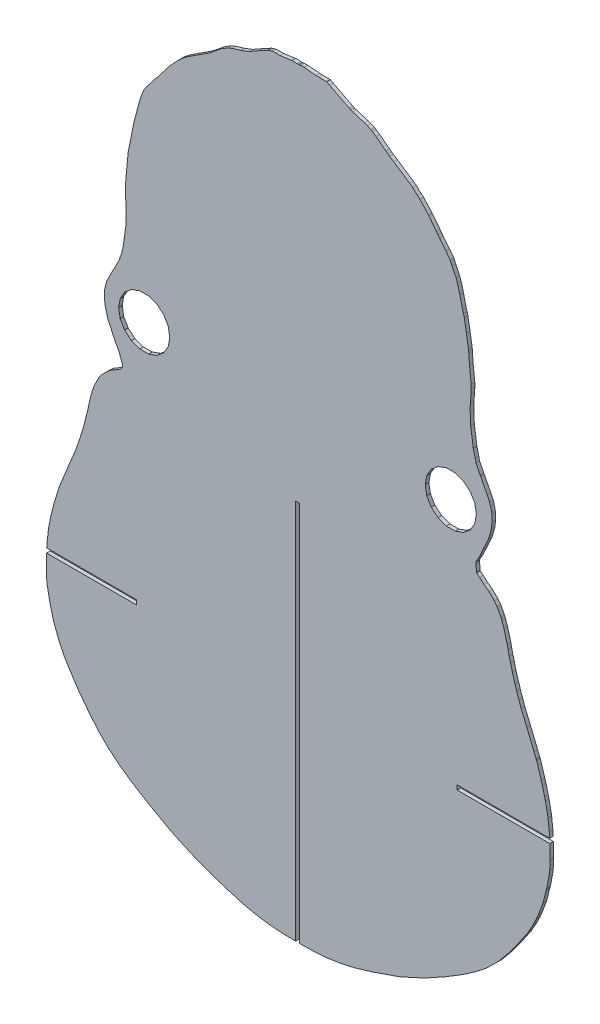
from build123d import *

# Parameters (mm, degrees)
EXTRUDE_1_DEPTH = 2


with BuildPart() as part:
    # Model → Extrude 1 (new body)
    with BuildSketch(Plane.XY):
        Polygon((-4974.158, -929.7955), (-4968.6351, -930.2084), (-4965.1293, -930.3378), (-4959.8611, -930.4225), (-4959.8611, -719.0788), (-4957.8611, -719.0788), (-4957.8611, -930.4371), (-4951.7398, -930.3629), (-4949.5986, -930.2921), (-4947.9002, -930.1979), (-4942.8325, -929.8058), (-4942.4503, -929.756), (-4935.1129, -928.6329), (-4934.8096, -928.5712), (-4934.5061, -928.5092), (-4927.6871, -926.9908), (-4926.8901, -926.7667), (-4921.6101, -925.1852), (-4919.9321, -924.703), (-4918.2541, -924.2206), (-4908.5771, -920.9071), (-4902.6554, -918.8368), (-4896.7513, -916.2242), (-4888.4404, -912.3805), (-4887.0179, -911.6324), (-4883.3795, -909.6022), (-4877.945, -906.5407), (-4877.4139, -906.285), (-4876.8827, -906.0292), (-4870.752, -902.2738), (-4865.5499, -899.0272), (-4864.6683, -898.4178), (-4863.5197, -897.5741), (-4862.3711, -896.7306), (-4859.876, -895.0631), (-4856.9983, -892.7367), (-4854.0229, -890.3763), (-4848.1192, -884.5961), (-4846.7538, -883.0995), (-4842.3308, -877.7321), (-4836.8335, -870.3651), (-4832.9334, -864.5707), (-4831.4924, -862.5199), (-4830.8341, -861.4086), (-4830.6526, -861.0438), (-4830.4712, -860.6793), (-4828.6733, -857.6239), (-4828.1669, -856.5897), (-4826.4759, -853.1464), (-4825.3825, -850.5316), (-4822.6957, -843.3907), (-4822.6899, -843.3458), (-4822.6841, -843.3009), (-4821.1044, -836.9054), (-4820.9418, -836.3578), (-4820.7793, -835.8099), (-4820.6542, -835.2631), (-4819.4245, -829.0065), (-4819.0711, -826.1041), (-4818.8331, -823.6173), (-4818.8422, -821.382), (-4818.8378, -821.0985), (-4818.8757, -820.3788), (-4818.9844, -813.0892), (-4870.3844, -813.0892), (-4870.3844, -812.8392), (-4870.3844, -810.8392), (-4870.3844, -810.5892), (-4819.0458, -810.5892), (-4819.2605, -807.7255), (-4819.9747, -801.4142), (-4820.2251, -799.7928), (-4821.3856, -793.9696), (-4821.8597, -792.1036), (-4823.0798, -787.2887), (-4823.752, -784.9999), (-4825.7052, -778.6901), (-4826.2635, -777.0309), (-4826.3465, -776.7943), (-4826.4295, -776.558), (-4826.5423, -776.2694), (-4826.6551, -775.9811), (-4827.7262, -773.4261), (-4831.693, -763.6888), (-4834.8637, -756.1723), (-4836.147, -752.5556), (-4837.3583, -749.0107), (-4838.2948, -746.0696), (-4839.7543, -741.1841), (-4840.73, -737.2285), (-4841.5153, -734.2759), (-4842.1721, -731.301), (-4842.5612, -729.4475), (-4844.4167, -722.4553), (-4845.615, -719.1135), (-4846.1162, -717.8667), (-4848.1593, -714.0344), (-4849.7675, -711.9243), (-4852.7505, -708.843), (-4855.4501, -706.9629), (-4857.8761, -704.7331), (-4859.5853, -703.469), (-4859.6002, -703.4375), (-4859.6152, -703.406), (-4859.6202, -703.1538), (-4859.9137, -699.2248), (-4859.8963, -698.3071), (-4859.1325, -696.74), (-4857.966, -694.8115), (-4856.0334, -690.5195), (-4856.0329, -690.5183), (-4856.0325, -690.5173), (-4856.0322, -690.5163), (-4852.987, -683.9487), (-4852.4202, -682.0217), (-4851.3934, -678.1655), (-4851.0131, -674.6946), (-4851.1242, -670.8762), (-4851.28, -669.9158), (-4851.8411, -667.6953), (-4852.3329, -665.9238), (-4853.6626, -662.9949), (-4857.2618, -656.0876), (-4857.4419, -655.7597), (-4857.6221, -655.4321), (-4857.6708, -655.3193), (-4859.894, -650.8657), (-4860.3363, -648.8789), (-4861.37, -644.7202), (-4861.4316, -644.3179), (-4862.8359, -634.3913), (-4862.841, -634.3581), (-4862.8462, -634.3249), (-4862.8466, -634.3218), (-4862.847, -634.3186), (-4863.1181, -627.4463), (-4863.0723, -623.7153), (-4862.6688, -619.4426), (-4862.5345, -616.4482), (-4862.5747, -614.5293), (-4863.5302, -605.414), (-4863.9102, -600.1826), (-4863.9584, -598.9465), (-4864.0995, -597.9158), (-4865.1712, -591.3637), (-4866.3972, -584.3789), (-4866.7994, -582.813), (-4867.3376, -580.9602), (-4868.8091, -574.6103), (-4870.1731, -569.5923), (-4871.0017, -567.237), (-4873.1798, -562.8191), (-4874.2875, -560.3891), (-4876.5796, -557.3596), (-4880.1191, -553.0461), (-4881.0413, -551.7251), (-4881.8473, -550.5952), (-4886.07, -545.1618), (-4886.1833, -545.021), (-4886.2966, -544.8804), (-4891.0608, -539.6433), (-4892.4383, -538.5622), (-4895.2125, -535.8989), (-4896.6491, -534.8926), (-4905.5206, -528.9497), (-4907.8607, -527.4783), (-4908.7246, -526.8691), (-4909.7869, -526.008), (-4915.2931, -521.7969), (-4917.3051, -520.4197), (-4917.7934, -520.1213), (-4918.2818, -519.823), (-4920.2479, -518.9287), (-4921.712, -518.3862), (-4928.1213, -516.4355), (-4928.5135, -516.3276), (-4928.9057, -516.2197), (-4929.3313, -516.0168), (-4929.8046, -515.7688), (-4930.2778, -515.5207), (-4941.071, -510.0259), (-4942.542, -509.2473), (-4942.7693, -509.1418), (-4947.0627, -509.094), (-4948.4269, -509.0908), (-4948.4885, -509.094), (-4948.55, -509.0974), (-4954.9997, -508.4509), (-4955.3121, -508.4067), (-4956.9597, -508.5312), (-4957.3478, -508.5642), (-4957.7359, -508.5971), (-4957.8421, -508.6238), (-4957.9483, -508.6504), (-4958.0066, -508.6513), (-4958.4723, -508.6294), (-4958.9379, -508.6076), (-4961.6012, -508.5432), (-4962.0373, -508.5957), (-4962.2339, -508.6333), (-4962.4303, -508.6709), (-4968.7091, -509.5178), (-4969.7684, -509.4753), (-4970.8276, -509.4328), (-4972.7218, -509.5388), (-4973.7364, -509.8718), (-4974.7509, -510.2051), (-4975.3609, -510.344), (-4977.9656, -511.8984), (-4979.7461, -512.7612), (-4985.8459, -516.2109), (-4990.3016, -517.8916), (-4990.573, -517.968), (-4994.9819, -519.2717), (-4997.1963, -520.2471), (-5000.6361, -522.1443), (-5000.9295, -522.3701), (-5001.2229, -522.5959), (-5007.8338, -527.9165), (-5013.9421, -531.8899), (-5019.9042, -535.7637), (-5023.0545, -538.1955), (-5025.4924, -540.4707), (-5029.9923, -545.3574), (-5030.0162, -545.3869), (-5030.04, -545.4165), (-5030.2854, -545.7341), (-5036.7858, -554.2068), (-5037.5456, -555.0381), (-5038.4139, -556.0493), (-5040.6311, -559.0368), (-5042.7709, -561.7732), (-5044.0081, -563.6841), (-5045.2438, -566.5271), (-5046.164, -569.4292), (-5046.6401, -570.9145), (-5049.4321, -581.6291), (-5049.4399, -581.6565), (-5049.4477, -581.6838), (-5049.4604, -581.7261), (-5049.4732, -581.7683), (-5050.3082, -585.8926), (-5052.7453, -597.9602), (-5053.0653, -601.185), (-5054.2401, -614.0129), (-5054.3111, -616.4817), (-5054.1294, -620.865), (-5053.8653, -624.2263), (-5053.8126, -627.0261), (-5054.0817, -634.468), (-5054.0818, -634.4709), (-5054.0818, -634.4741), (-5054.0818, -634.4753), (-5054.082, -634.478), (-5055.513, -644.4607), (-5055.6158, -645.0737), (-5056.5313, -649.0344), (-5057.1505, -650.3149), (-5057.5707, -652.0019), (-5059.2935, -655.3701), (-5059.3111, -655.4184), (-5059.3287, -655.467), (-5059.3846, -655.5666), (-5059.4406, -655.6665), (-5063.3718, -663.1562), (-5064.6885, -666.0378), (-5065.1107, -667.7178), (-5065.6793, -669.821), (-5065.8625, -670.8962), (-5065.9435, -674.4319), (-5065.525, -677.9663), (-5064.442, -682.1885), (-5063.8631, -684.1135), (-5062.1041, -687.7156), (-5061.7643, -688.6572), (-5061.323, -689.675), (-5058.7935, -694.5998), (-5057.3415, -697.331), (-5057.1786, -698.1245), (-5055.9685, -701.3669), (-5055.9156, -702.7766), (-5057.136, -704.5237), (-5061.8888, -707.1865), (-5063.264, -708.1726), (-5063.5638, -708.4267), (-5063.8636, -708.6809), (-5067.2123, -711.9514), (-5067.8894, -712.8371), (-5068.7171, -713.8647), (-5069.3651, -715.1662), (-5071.3375, -718.8957), (-5072.6297, -722.4228), (-5074.1659, -728.3747), (-5074.7159, -730.8867), (-5075.4173, -734.1169), (-5076.2616, -737.3086), (-5077.2062, -741.1899), (-5078.5041, -745.5989), (-5079.3273, -748.2143), (-5080.6569, -752.125), (-5082.0079, -755.9734), (-5085.2583, -763.7289), (-5089.6342, -774.4716), (-5090.5229, -776.5992), (-5090.6801, -777.0006), (-5090.7388, -777.1683), (-5090.7975, -777.3361), (-5091.1838, -778.4845), (-5093.0766, -784.6451), (-5093.8112, -787.0807), (-5095.1102, -792.184), (-5095.5961, -794.0072), (-5096.8094, -800.1559), (-5097.0365, -801.7372), (-5097.7363, -808.0878), (-5097.9212, -810.5892), (-5048.1548, -810.5892), (-5048.1548, -810.8392), (-5048.1548, -812.8392), (-5048.1548, -813.0892), (-5097.9894, -813.0892), (-5098.0832, -819.8751), (-5098.128, -820.705), (-5098.1254, -820.8866), (-5098.1227, -821.0685), (-5098.1179, -823.777), (-5097.9231, -825.785), (-5097.6063, -828.5472), (-5096.0934, -836.2472), (-5096.0822, -836.3363), (-5096.071, -836.4257), (-5096.0315, -836.5878), (-5095.9921, -836.7496), (-5094.0677, -844.0004), (-5091.8276, -849.8749), (-5090.4521, -853.1967), (-5088.7991, -856.5538), (-5088.5088, -857.14), (-5088.2186, -857.7264), (-5086.3559, -860.848), (-5086.1883, -861.1923), (-5086.0206, -861.5363), (-5084.2698, -863.9178), (-5083.826, -864.7177), (-5083.3823, -865.5172), (-5080.1811, -870.297), (-5078.3669, -872.6993), (-5074.7412, -877.5411), (-5069.9459, -883.2941), (-5069.3696, -883.9428), (-5068.7933, -884.5917), (-5068.5794, -884.8143), (-5068.3655, -885.0372), (-5063.2694, -890.1049), (-5062.4997, -890.6273), (-5059.2945, -893.3265), (-5058.1641, -894.2294), (-5057.0337, -895.1324), (-5053.5307, -897.5194), (-5052.0913, -898.5736), (-5051.706, -898.8422), (-5048.4551, -900.9313), (-5041.6824, -905.0778), (-5039.4375, -906.3204), (-5033.5016, -909.6642), (-5029.9157, -911.6671), (-5028.5139, -912.4069), (-5019.8243, -916.4142), (-5014.6201, -918.7194), (-5007.1617, -921.3346), (-4999.8722, -923.9178), (-4993.986, -925.5853), (-4990.1852, -926.744), (-4989.4092, -926.9618), (-4982.4026, -928.5233), (-4982.0816, -928.5887), (-4981.7606, -928.6539), (-4974.4564, -929.7584), align=None)
        Polygon((-4866.7734, -663.0473), (-4863.0021, -666.2119), (-4860.5406, -670.4753), (-4859.6857, -675.3235), (-4860.5406, -680.1719), (-4863.0021, -684.4353), (-4866.7734, -687.5998), (-4871.3996, -689.2837), (-4876.3227, -689.2837), (-4880.9488, -687.5998), (-4884.7201, -684.4353), (-4887.1817, -680.1719), (-4888.0366, -675.3237), (-4887.1817, -670.4753), (-4884.7201, -666.2119), (-4880.9488, -663.0473), (-4876.3227, -661.3635), (-4871.3996, -661.3635), align=None, mode=Mode.SUBTRACT)
        Polygon((-5057.1817, -680.1719), (-5054.7201, -684.4353), (-5050.9488, -687.5998), (-5046.3227, -689.2837), (-5041.3996, -689.2837), (-5036.7734, -687.5998), (-5033.0021, -684.4353), (-5030.5406, -680.1719), (-5029.6857, -675.3235), (-5030.5406, -670.4753), (-5033.0021, -666.2119), (-5036.7734, -663.0473), (-5041.3996, -661.3635), (-5046.3227, -661.3635), (-5050.9488, -663.0473), (-5054.7201, -666.2119), (-5057.1817, -670.4753), (-5058.0366, -675.3237), align=None, mode=Mode.SUBTRACT)
    extrude(amount=EXTRUDE_1_DEPTH)


solid = part.part
